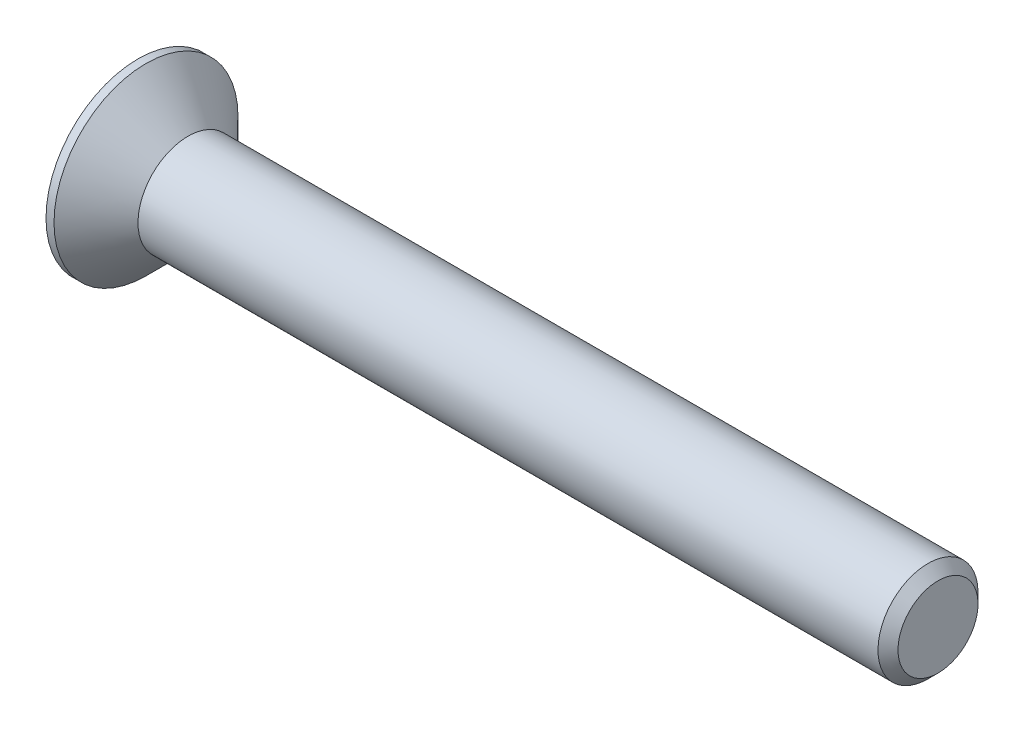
ISO-10303-21;
HEADER;
FILE_DESCRIPTION(('STEP AP214'),'2;1');
FILE_NAME('part.step','',(''),(''),'','','');
FILE_SCHEMA(('AUTOMOTIVE_DESIGN { 1 0 10303 214 1 1 1 1 }'));
ENDSEC;
DATA;
#1=APPLICATION_CONTEXT('core data for automotive mechanical design processes');
#2=APPLICATION_PROTOCOL_DEFINITION('international standard','automotive_design',2000,#1);
#3=PRODUCT_CONTEXT('',#1,'mechanical');
#4=PRODUCT('Part','Part','',(#3));
#5=PRODUCT_RELATED_PRODUCT_CATEGORY('part','',(#4));
#6=PRODUCT_DEFINITION_FORMATION('','',#4);
#7=PRODUCT_DEFINITION_CONTEXT('part definition',#1,'design');
#8=PRODUCT_DEFINITION('design','',#6,#7);
#9=PRODUCT_DEFINITION_SHAPE('','',#8);
#10=(LENGTH_UNIT() NAMED_UNIT(*) SI_UNIT(.MILLI.,.METRE.));
#11=(NAMED_UNIT(*) PLANE_ANGLE_UNIT() SI_UNIT($,.RADIAN.));
#12=(NAMED_UNIT(*) SI_UNIT($,.STERADIAN.) SOLID_ANGLE_UNIT());
#13=UNCERTAINTY_MEASURE_WITH_UNIT(LENGTH_MEASURE(1.E-05),#10,'distance_accuracy_value','');
#14=(GEOMETRIC_REPRESENTATION_CONTEXT(3) GLOBAL_UNCERTAINTY_ASSIGNED_CONTEXT((#13)) GLOBAL_UNIT_ASSIGNED_CONTEXT((#10,
#11,#12)) REPRESENTATION_CONTEXT('',''));
#15=CARTESIAN_POINT('',(0.,0.,0.));
#16=DIRECTION('',(0.,0.,1.));
#17=DIRECTION('',(1.,0.,0.));
#18=AXIS2_PLACEMENT_3D('',#15,#16,#17);
#19=CARTESIAN_POINT('',(0.,0.,0.));
#20=DIRECTION('',(-1.,0.,0.));
#21=DIRECTION('',(0.,-1.,0.));
#22=AXIS2_PLACEMENT_3D('',#19,#20,#21);
#23=CONICAL_SURFACE('',#22,2.5,0.78539816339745);
#24=CARTESIAN_POINT('',(-2.09999999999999,0.,0.));
#25=DIRECTION('',(-1.,0.,0.));
#26=DIRECTION('',(0.,-1.,0.));
#27=AXIS2_PLACEMENT_3D('',#24,#25,#26);
#28=CIRCLE('',#27,4.6);
#29=CARTESIAN_POINT('',(-2.09999999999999,-4.6,0.));
#30=VERTEX_POINT('',#29);
#31=EDGE_CURVE('E189',#30,#30,#28,.T.);
#32=ORIENTED_EDGE('',*,*,#31,.F.);
#33=EDGE_LOOP('',(#32));
#34=FACE_BOUND('',#33,.T.);
#35=CARTESIAN_POINT('',(0.,0.,0.));
#36=DIRECTION('',(-1.,0.,0.));
#37=DIRECTION('',(0.,-1.,0.));
#38=AXIS2_PLACEMENT_3D('',#35,#36,#37);
#39=CIRCLE('',#38,2.5);
#40=CARTESIAN_POINT('',(0.,-2.5,0.));
#41=VERTEX_POINT('',#40);
#42=EDGE_CURVE('E212',#41,#41,#39,.T.);
#43=ORIENTED_EDGE('',*,*,#42,.T.);
#44=EDGE_LOOP('',(#43));
#45=FACE_BOUND('',#44,.T.);
#46=ADVANCED_FACE('F33',(#34,#45),#23,.T.);
#47=CARTESIAN_POINT('',(-2.5,0.,0.));
#48=DIRECTION('',(-1.,0.,0.));
#49=DIRECTION('',(0.,-1.,0.));
#50=AXIS2_PLACEMENT_3D('',#47,#48,#49);
#51=CYLINDRICAL_SURFACE('',#50,2.5);
#52=CARTESIAN_POINT('',(37.,0.,0.));
#53=DIRECTION('',(-1.,0.,0.));
#54=DIRECTION('',(0.,-1.,0.));
#55=AXIS2_PLACEMENT_3D('',#52,#53,#54);
#56=CIRCLE('',#55,2.5);
#57=CARTESIAN_POINT('',(37.,-2.5,0.));
#58=VERTEX_POINT('',#57);
#59=EDGE_CURVE('E41',#58,#58,#56,.T.);
#60=ORIENTED_EDGE('',*,*,#59,.T.);
#61=EDGE_LOOP('',(#60));
#62=FACE_BOUND('',#61,.T.);
#63=ORIENTED_EDGE('',*,*,#42,.F.);
#64=EDGE_LOOP('',(#63));
#65=FACE_BOUND('',#64,.T.);
#66=ADVANCED_FACE('F217',(#62,#65),#51,.T.);
#67=CARTESIAN_POINT('',(37.5,0.,0.));
#68=DIRECTION('',(-1.,0.,0.));
#69=DIRECTION('',(0.,-1.,0.));
#70=AXIS2_PLACEMENT_3D('',#67,#68,#69);
#71=PLANE('',#70);
#72=CARTESIAN_POINT('',(37.5,0.,0.));
#73=DIRECTION('',(-1.,0.,0.));
#74=DIRECTION('',(0.,-1.,0.));
#75=AXIS2_PLACEMENT_3D('',#72,#73,#74);
#76=CIRCLE('',#75,2.00000000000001);
#77=CARTESIAN_POINT('',(37.5,-2.00000000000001,0.));
#78=VERTEX_POINT('',#77);
#79=EDGE_CURVE('E11',#78,#78,#76,.F.);
#80=ORIENTED_EDGE('',*,*,#79,.T.);
#81=EDGE_LOOP('',(#80));
#82=FACE_BOUND('',#81,.T.);
#83=ADVANCED_FACE('F239',(#82),#71,.F.);
#84=CARTESIAN_POINT('',(-2.5,4.6,0.));
#85=DIRECTION('',(1.,0.,0.));
#86=DIRECTION('',(0.,1.,0.));
#87=AXIS2_PLACEMENT_3D('',#84,#85,#86);
#88=PLANE('',#87);
#89=DIRECTION('',(0.,0.,-1.));
#90=VECTOR('',#89,1.);
#91=CARTESIAN_POINT('',(-2.5,0.575,-2.3));
#92=LINE('',#91,#90);
#93=CARTESIAN_POINT('',(-2.5,0.575,-0.575));
#94=VERTEX_POINT('',#93);
#95=CARTESIAN_POINT('',(-2.5,0.575,-2.3));
#96=VERTEX_POINT('',#95);
#97=EDGE_CURVE('E158',#94,#96,#92,.T.);
#98=ORIENTED_EDGE('',*,*,#97,.F.);
#99=DIRECTION('',(0.,-1.,0.));
#100=VECTOR('',#99,1.);
#101=CARTESIAN_POINT('',(-2.5,0.575,-0.575));
#102=LINE('',#101,#100);
#103=CARTESIAN_POINT('',(-2.5,2.3,-0.575));
#104=VERTEX_POINT('',#103);
#105=EDGE_CURVE('E48',#104,#94,#102,.T.);
#106=ORIENTED_EDGE('',*,*,#105,.F.);
#107=DIRECTION('',(0.,0.,-1.));
#108=VECTOR('',#107,1.);
#109=CARTESIAN_POINT('',(-2.5,2.3,-0.575));
#110=LINE('',#109,#108);
#111=CARTESIAN_POINT('',(-2.5,2.3,0.575));
#112=VERTEX_POINT('',#111);
#113=EDGE_CURVE('E185',#112,#104,#110,.T.);
#114=ORIENTED_EDGE('',*,*,#113,.F.);
#115=DIRECTION('',(0.,1.,0.));
#116=VECTOR('',#115,1.);
#117=CARTESIAN_POINT('',(-2.5,2.3,0.575));
#118=LINE('',#117,#116);
#119=CARTESIAN_POINT('',(-2.5,0.575,0.575));
#120=VERTEX_POINT('',#119);
#121=EDGE_CURVE('E183',#120,#112,#118,.T.);
#122=ORIENTED_EDGE('',*,*,#121,.F.);
#123=DIRECTION('',(0.,0.,-1.));
#124=VECTOR('',#123,1.);
#125=CARTESIAN_POINT('',(-2.5,0.575,0.575));
#126=LINE('',#125,#124);
#127=CARTESIAN_POINT('',(-2.5,0.575,2.3));
#128=VERTEX_POINT('',#127);
#129=EDGE_CURVE('E132',#128,#120,#126,.T.);
#130=ORIENTED_EDGE('',*,*,#129,.F.);
#131=DIRECTION('',(0.,1.,0.));
#132=VECTOR('',#131,1.);
#133=CARTESIAN_POINT('',(-2.5,0.575,2.3));
#134=LINE('',#133,#132);
#135=CARTESIAN_POINT('',(-2.5,-0.575,2.3));
#136=VERTEX_POINT('',#135);
#137=EDGE_CURVE('E179',#136,#128,#134,.T.);
#138=ORIENTED_EDGE('',*,*,#137,.F.);
#139=DIRECTION('',(0.,0.,1.));
#140=VECTOR('',#139,1.);
#141=CARTESIAN_POINT('',(-2.5,-0.575,2.3));
#142=LINE('',#141,#140);
#143=CARTESIAN_POINT('',(-2.5,-0.575,0.575));
#144=VERTEX_POINT('',#143);
#145=EDGE_CURVE('E176',#144,#136,#142,.T.);
#146=ORIENTED_EDGE('',*,*,#145,.F.);
#147=DIRECTION('',(0.,1.,0.));
#148=VECTOR('',#147,1.);
#149=CARTESIAN_POINT('',(-2.5,-0.575,0.575));
#150=LINE('',#149,#148);
#151=CARTESIAN_POINT('',(-2.5,-2.3,0.575));
#152=VERTEX_POINT('',#151);
#153=EDGE_CURVE('E173',#152,#144,#150,.T.);
#154=ORIENTED_EDGE('',*,*,#153,.F.);
#155=DIRECTION('',(0.,0.,1.));
#156=VECTOR('',#155,1.);
#157=CARTESIAN_POINT('',(-2.5,-2.3,0.575));
#158=LINE('',#157,#156);
#159=CARTESIAN_POINT('',(-2.5,-2.3,-0.575));
#160=VERTEX_POINT('',#159);
#161=EDGE_CURVE('E170',#160,#152,#158,.T.);
#162=ORIENTED_EDGE('',*,*,#161,.F.);
#163=DIRECTION('',(0.,-1.,0.));
#164=VECTOR('',#163,1.);
#165=CARTESIAN_POINT('',(-2.5,-2.3,-0.575));
#166=LINE('',#165,#164);
#167=CARTESIAN_POINT('',(-2.5,-0.575,-0.575));
#168=VERTEX_POINT('',#167);
#169=EDGE_CURVE('E167',#168,#160,#166,.T.);
#170=ORIENTED_EDGE('',*,*,#169,.F.);
#171=DIRECTION('',(0.,0.,1.));
#172=VECTOR('',#171,1.);
#173=CARTESIAN_POINT('',(-2.5,-0.575,-0.575));
#174=LINE('',#173,#172);
#175=CARTESIAN_POINT('',(-2.5,-0.575,-2.3));
#176=VERTEX_POINT('',#175);
#177=EDGE_CURVE('E164',#176,#168,#174,.T.);
#178=ORIENTED_EDGE('',*,*,#177,.F.);
#179=DIRECTION('',(0.,-1.,0.));
#180=VECTOR('',#179,1.);
#181=CARTESIAN_POINT('',(-2.5,-0.575,-2.3));
#182=LINE('',#181,#180);
#183=EDGE_CURVE('E161',#96,#176,#182,.T.);
#184=ORIENTED_EDGE('',*,*,#183,.F.);
#185=EDGE_LOOP('',(#98,#106,#114,#122,#130,#138,#146,#154,#162,#170,#178,#184));
#186=FACE_BOUND('',#185,.T.);
#187=CARTESIAN_POINT('',(-2.5,0.,0.));
#188=DIRECTION('',(-1.,0.,0.));
#189=DIRECTION('',(0.,-1.,0.));
#190=AXIS2_PLACEMENT_3D('',#187,#188,#189);
#191=CIRCLE('',#190,4.6);
#192=CARTESIAN_POINT('',(-2.5,-4.6,0.));
#193=VERTEX_POINT('',#192);
#194=EDGE_CURVE('E209',#193,#193,#191,.T.);
#195=ORIENTED_EDGE('',*,*,#194,.T.);
#196=EDGE_LOOP('',(#195));
#197=FACE_BOUND('',#196,.T.);
#198=ADVANCED_FACE('F230',(#186,#197),#88,.F.);
#199=CARTESIAN_POINT('',(-2.5,0.,0.));
#200=DIRECTION('',(-1.,0.,0.));
#201=DIRECTION('',(0.,-1.,0.));
#202=AXIS2_PLACEMENT_3D('',#199,#200,#201);
#203=CYLINDRICAL_SURFACE('',#202,4.6);
#204=ORIENTED_EDGE('',*,*,#194,.F.);
#205=EDGE_LOOP('',(#204));
#206=FACE_BOUND('',#205,.T.);
#207=ORIENTED_EDGE('',*,*,#31,.T.);
#208=EDGE_LOOP('',(#207));
#209=FACE_BOUND('',#208,.T.);
#210=ADVANCED_FACE('F222',(#206,#209),#203,.T.);
#211=CARTESIAN_POINT('',(37.,0.,0.));
#212=DIRECTION('',(-1.,0.,0.));
#213=DIRECTION('',(0.,-1.,0.));
#214=AXIS2_PLACEMENT_3D('',#211,#212,#213);
#215=CONICAL_SURFACE('',#214,2.5,0.785398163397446);
#216=ORIENTED_EDGE('',*,*,#79,.F.);
#217=EDGE_LOOP('',(#216));
#218=FACE_BOUND('',#217,.T.);
#219=ORIENTED_EDGE('',*,*,#59,.F.);
#220=EDGE_LOOP('',(#219));
#221=FACE_BOUND('',#220,.T.);
#222=ADVANCED_FACE('F35',(#218,#221),#215,.T.);
#223=CARTESIAN_POINT('',(-0.4,0.575,-0.575));
#224=DIRECTION('',(0.,0.,-1.));
#225=DIRECTION('',(-1.,0.,0.));
#226=AXIS2_PLACEMENT_3D('',#223,#224,#225);
#227=PLANE('',#226);
#228=ORIENTED_EDGE('',*,*,#105,.T.);
#229=DIRECTION('',(-1.,0.,0.));
#230=VECTOR('',#229,1.);
#231=CARTESIAN_POINT('',(-0.4,0.575,-0.575));
#232=LINE('',#231,#230);
#233=CARTESIAN_POINT('',(-0.4,0.575,-0.575));
#234=VERTEX_POINT('',#233);
#235=EDGE_CURVE('E96',#234,#94,#232,.T.);
#236=ORIENTED_EDGE('',*,*,#235,.F.);
#237=DIRECTION('',(0.,-1.,0.));
#238=VECTOR('',#237,1.);
#239=CARTESIAN_POINT('',(-0.4,0.575,-0.575));
#240=LINE('',#239,#238);
#241=CARTESIAN_POINT('',(-0.4,2.3,-0.575));
#242=VERTEX_POINT('',#241);
#243=EDGE_CURVE('E187',#242,#234,#240,.T.);
#244=ORIENTED_EDGE('',*,*,#243,.F.);
#245=DIRECTION('',(-1.,0.,0.));
#246=VECTOR('',#245,1.);
#247=CARTESIAN_POINT('',(-0.4,2.3,-0.575));
#248=LINE('',#247,#246);
#249=EDGE_CURVE('E56',#242,#104,#248,.T.);
#250=ORIENTED_EDGE('',*,*,#249,.T.);
#251=EDGE_LOOP('',(#228,#236,#244,#250));
#252=FACE_BOUND('',#251,.T.);
#253=ADVANCED_FACE('F221',(#252),#227,.F.);
#254=CARTESIAN_POINT('',(-0.4,2.3,-0.575));
#255=DIRECTION('',(0.,1.,0.));
#256=DIRECTION('',(-1.,0.,0.));
#257=AXIS2_PLACEMENT_3D('',#254,#255,#256);
#258=PLANE('',#257);
#259=ORIENTED_EDGE('',*,*,#113,.T.);
#260=ORIENTED_EDGE('',*,*,#249,.F.);
#261=DIRECTION('',(0.,0.,-1.));
#262=VECTOR('',#261,1.);
#263=CARTESIAN_POINT('',(-0.4,2.3,-0.575));
#264=LINE('',#263,#262);
#265=CARTESIAN_POINT('',(-0.4,2.3,0.575));
#266=VERTEX_POINT('',#265);
#267=EDGE_CURVE('E144',#266,#242,#264,.T.);
#268=ORIENTED_EDGE('',*,*,#267,.F.);
#269=DIRECTION('',(-1.,0.,0.));
#270=VECTOR('',#269,1.);
#271=CARTESIAN_POINT('',(-0.4,2.3,0.575));
#272=LINE('',#271,#270);
#273=EDGE_CURVE('E136',#266,#112,#272,.T.);
#274=ORIENTED_EDGE('',*,*,#273,.T.);
#275=EDGE_LOOP('',(#259,#260,#268,#274));
#276=FACE_BOUND('',#275,.T.);
#277=ADVANCED_FACE('F228',(#276),#258,.F.);
#278=CARTESIAN_POINT('',(-0.4,2.3,0.575));
#279=DIRECTION('',(0.,0.,1.));
#280=DIRECTION('',(1.,0.,0.));
#281=AXIS2_PLACEMENT_3D('',#278,#279,#280);
#282=PLANE('',#281);
#283=ORIENTED_EDGE('',*,*,#121,.T.);
#284=ORIENTED_EDGE('',*,*,#273,.F.);
#285=DIRECTION('',(0.,1.,0.));
#286=VECTOR('',#285,1.);
#287=CARTESIAN_POINT('',(-0.4,2.3,0.575));
#288=LINE('',#287,#286);
#289=CARTESIAN_POINT('',(-0.4,0.575,0.575));
#290=VERTEX_POINT('',#289);
#291=EDGE_CURVE('E140',#290,#266,#288,.T.);
#292=ORIENTED_EDGE('',*,*,#291,.F.);
#293=DIRECTION('',(-1.,0.,0.));
#294=VECTOR('',#293,1.);
#295=CARTESIAN_POINT('',(-0.4,0.575,0.575));
#296=LINE('',#295,#294);
#297=EDGE_CURVE('E125',#290,#120,#296,.T.);
#298=ORIENTED_EDGE('',*,*,#297,.T.);
#299=EDGE_LOOP('',(#283,#284,#292,#298));
#300=FACE_BOUND('',#299,.T.);
#301=ADVANCED_FACE('F141',(#300),#282,.F.);
#302=CARTESIAN_POINT('',(-0.4,0.575,0.575));
#303=DIRECTION('',(0.,1.,0.));
#304=DIRECTION('',(-1.,0.,0.));
#305=AXIS2_PLACEMENT_3D('',#302,#303,#304);
#306=PLANE('',#305);
#307=ORIENTED_EDGE('',*,*,#129,.T.);
#308=ORIENTED_EDGE('',*,*,#297,.F.);
#309=DIRECTION('',(0.,0.,-1.));
#310=VECTOR('',#309,1.);
#311=CARTESIAN_POINT('',(-0.4,0.575,0.575));
#312=LINE('',#311,#310);
#313=CARTESIAN_POINT('',(-0.4,0.575,2.3));
#314=VERTEX_POINT('',#313);
#315=EDGE_CURVE('E129',#314,#290,#312,.T.);
#316=ORIENTED_EDGE('',*,*,#315,.F.);
#317=DIRECTION('',(-1.,0.,0.));
#318=VECTOR('',#317,1.);
#319=CARTESIAN_POINT('',(-0.4,0.575,2.3));
#320=LINE('',#319,#318);
#321=EDGE_CURVE('E137',#314,#128,#320,.T.);
#322=ORIENTED_EDGE('',*,*,#321,.T.);
#323=EDGE_LOOP('',(#307,#308,#316,#322));
#324=FACE_BOUND('',#323,.T.);
#325=ADVANCED_FACE('F127',(#324),#306,.F.);
#326=CARTESIAN_POINT('',(-0.4,0.575,2.3));
#327=DIRECTION('',(0.,0.,1.));
#328=DIRECTION('',(1.,0.,0.));
#329=AXIS2_PLACEMENT_3D('',#326,#327,#328);
#330=PLANE('',#329);
#331=ORIENTED_EDGE('',*,*,#137,.T.);
#332=ORIENTED_EDGE('',*,*,#321,.F.);
#333=DIRECTION('',(0.,1.,0.));
#334=VECTOR('',#333,1.);
#335=CARTESIAN_POINT('',(-0.4,0.575,2.3));
#336=LINE('',#335,#334);
#337=CARTESIAN_POINT('',(-0.4,-0.575,2.3));
#338=VERTEX_POINT('',#337);
#339=EDGE_CURVE('E150',#338,#314,#336,.T.);
#340=ORIENTED_EDGE('',*,*,#339,.F.);
#341=DIRECTION('',(-1.,0.,0.));
#342=VECTOR('',#341,1.);
#343=CARTESIAN_POINT('',(-0.4,-0.575,2.3));
#344=LINE('',#343,#342);
#345=EDGE_CURVE('E192',#338,#136,#344,.T.);
#346=ORIENTED_EDGE('',*,*,#345,.T.);
#347=EDGE_LOOP('',(#331,#332,#340,#346));
#348=FACE_BOUND('',#347,.T.);
#349=ADVANCED_FACE('F277',(#348),#330,.F.);
#350=CARTESIAN_POINT('',(-0.4,-0.575,2.3));
#351=DIRECTION('',(0.,-1.,0.));
#352=DIRECTION('',(1.,0.,0.));
#353=AXIS2_PLACEMENT_3D('',#350,#351,#352);
#354=PLANE('',#353);
#355=ORIENTED_EDGE('',*,*,#145,.T.);
#356=ORIENTED_EDGE('',*,*,#345,.F.);
#357=DIRECTION('',(0.,0.,1.));
#358=VECTOR('',#357,1.);
#359=CARTESIAN_POINT('',(-0.4,-0.575,2.3));
#360=LINE('',#359,#358);
#361=CARTESIAN_POINT('',(-0.4,-0.575,0.575));
#362=VERTEX_POINT('',#361);
#363=EDGE_CURVE('E152',#362,#338,#360,.T.);
#364=ORIENTED_EDGE('',*,*,#363,.F.);
#365=DIRECTION('',(-1.,0.,0.));
#366=VECTOR('',#365,1.);
#367=CARTESIAN_POINT('',(-0.4,-0.575,0.575));
#368=LINE('',#367,#366);
#369=EDGE_CURVE('E194',#362,#144,#368,.T.);
#370=ORIENTED_EDGE('',*,*,#369,.T.);
#371=EDGE_LOOP('',(#355,#356,#364,#370));
#372=FACE_BOUND('',#371,.T.);
#373=ADVANCED_FACE('F273',(#372),#354,.F.);
#374=CARTESIAN_POINT('',(-0.4,-0.575,0.575));
#375=DIRECTION('',(0.,0.,1.));
#376=DIRECTION('',(1.,0.,0.));
#377=AXIS2_PLACEMENT_3D('',#374,#375,#376);
#378=PLANE('',#377);
#379=ORIENTED_EDGE('',*,*,#153,.T.);
#380=ORIENTED_EDGE('',*,*,#369,.F.);
#381=DIRECTION('',(0.,1.,0.));
#382=VECTOR('',#381,1.);
#383=CARTESIAN_POINT('',(-0.4,-0.575,0.575));
#384=LINE('',#383,#382);
#385=CARTESIAN_POINT('',(-0.4,-2.3,0.575));
#386=VERTEX_POINT('',#385);
#387=EDGE_CURVE('E422',#386,#362,#384,.T.);
#388=ORIENTED_EDGE('',*,*,#387,.F.);
#389=DIRECTION('',(-1.,0.,0.));
#390=VECTOR('',#389,1.);
#391=CARTESIAN_POINT('',(-0.4,-2.3,0.575));
#392=LINE('',#391,#390);
#393=EDGE_CURVE('E196',#386,#152,#392,.T.);
#394=ORIENTED_EDGE('',*,*,#393,.T.);
#395=EDGE_LOOP('',(#379,#380,#388,#394));
#396=FACE_BOUND('',#395,.T.);
#397=ADVANCED_FACE('F269',(#396),#378,.F.);
#398=CARTESIAN_POINT('',(-0.4,-2.3,0.575));
#399=DIRECTION('',(0.,-1.,0.));
#400=DIRECTION('',(1.,0.,0.));
#401=AXIS2_PLACEMENT_3D('',#398,#399,#400);
#402=PLANE('',#401);
#403=ORIENTED_EDGE('',*,*,#161,.T.);
#404=ORIENTED_EDGE('',*,*,#393,.F.);
#405=DIRECTION('',(0.,0.,1.));
#406=VECTOR('',#405,1.);
#407=CARTESIAN_POINT('',(-0.4,-2.3,0.575));
#408=LINE('',#407,#406);
#409=CARTESIAN_POINT('',(-0.4,-2.3,-0.575));
#410=VERTEX_POINT('',#409);
#411=EDGE_CURVE('E419',#410,#386,#408,.T.);
#412=ORIENTED_EDGE('',*,*,#411,.F.);
#413=DIRECTION('',(-1.,0.,0.));
#414=VECTOR('',#413,1.);
#415=CARTESIAN_POINT('',(-0.4,-2.3,-0.575));
#416=LINE('',#415,#414);
#417=EDGE_CURVE('E198',#410,#160,#416,.T.);
#418=ORIENTED_EDGE('',*,*,#417,.T.);
#419=EDGE_LOOP('',(#403,#404,#412,#418));
#420=FACE_BOUND('',#419,.T.);
#421=ADVANCED_FACE('F265',(#420),#402,.F.);
#422=CARTESIAN_POINT('',(-0.4,-2.3,-0.575));
#423=DIRECTION('',(0.,0.,-1.));
#424=DIRECTION('',(-1.,0.,0.));
#425=AXIS2_PLACEMENT_3D('',#422,#423,#424);
#426=PLANE('',#425);
#427=ORIENTED_EDGE('',*,*,#169,.T.);
#428=ORIENTED_EDGE('',*,*,#417,.F.);
#429=DIRECTION('',(0.,-1.,0.));
#430=VECTOR('',#429,1.);
#431=CARTESIAN_POINT('',(-0.4,-2.3,-0.575));
#432=LINE('',#431,#430);
#433=CARTESIAN_POINT('',(-0.4,-0.575,-0.575));
#434=VERTEX_POINT('',#433);
#435=EDGE_CURVE('E416',#434,#410,#432,.T.);
#436=ORIENTED_EDGE('',*,*,#435,.F.);
#437=DIRECTION('',(-1.,0.,0.));
#438=VECTOR('',#437,1.);
#439=CARTESIAN_POINT('',(-0.4,-0.575,-0.575));
#440=LINE('',#439,#438);
#441=EDGE_CURVE('E200',#434,#168,#440,.T.);
#442=ORIENTED_EDGE('',*,*,#441,.T.);
#443=EDGE_LOOP('',(#427,#428,#436,#442));
#444=FACE_BOUND('',#443,.T.);
#445=ADVANCED_FACE('F261',(#444),#426,.F.);
#446=CARTESIAN_POINT('',(-0.4,-0.575,-0.575));
#447=DIRECTION('',(0.,-1.,0.));
#448=DIRECTION('',(1.,0.,0.));
#449=AXIS2_PLACEMENT_3D('',#446,#447,#448);
#450=PLANE('',#449);
#451=ORIENTED_EDGE('',*,*,#177,.T.);
#452=ORIENTED_EDGE('',*,*,#441,.F.);
#453=DIRECTION('',(0.,0.,1.));
#454=VECTOR('',#453,1.);
#455=CARTESIAN_POINT('',(-0.4,-0.575,-0.575));
#456=LINE('',#455,#454);
#457=CARTESIAN_POINT('',(-0.4,-0.575,-2.3));
#458=VERTEX_POINT('',#457);
#459=EDGE_CURVE('E413',#458,#434,#456,.T.);
#460=ORIENTED_EDGE('',*,*,#459,.F.);
#461=DIRECTION('',(-1.,0.,0.));
#462=VECTOR('',#461,1.);
#463=CARTESIAN_POINT('',(-0.4,-0.575,-2.3));
#464=LINE('',#463,#462);
#465=EDGE_CURVE('E202',#458,#176,#464,.T.);
#466=ORIENTED_EDGE('',*,*,#465,.T.);
#467=EDGE_LOOP('',(#451,#452,#460,#466));
#468=FACE_BOUND('',#467,.T.);
#469=ADVANCED_FACE('F257',(#468),#450,.F.);
#470=CARTESIAN_POINT('',(-0.4,-0.575,-2.3));
#471=DIRECTION('',(0.,0.,-1.));
#472=DIRECTION('',(-1.,0.,0.));
#473=AXIS2_PLACEMENT_3D('',#470,#471,#472);
#474=PLANE('',#473);
#475=ORIENTED_EDGE('',*,*,#183,.T.);
#476=ORIENTED_EDGE('',*,*,#465,.F.);
#477=DIRECTION('',(0.,-1.,0.));
#478=VECTOR('',#477,1.);
#479=CARTESIAN_POINT('',(-0.4,-0.575,-2.3));
#480=LINE('',#479,#478);
#481=CARTESIAN_POINT('',(-0.4,0.575,-2.3));
#482=VERTEX_POINT('',#481);
#483=EDGE_CURVE('E408',#482,#458,#480,.T.);
#484=ORIENTED_EDGE('',*,*,#483,.F.);
#485=DIRECTION('',(-1.,0.,0.));
#486=VECTOR('',#485,1.);
#487=CARTESIAN_POINT('',(-0.4,0.575,-2.3));
#488=LINE('',#487,#486);
#489=EDGE_CURVE('E204',#482,#96,#488,.T.);
#490=ORIENTED_EDGE('',*,*,#489,.T.);
#491=EDGE_LOOP('',(#475,#476,#484,#490));
#492=FACE_BOUND('',#491,.T.);
#493=ADVANCED_FACE('F253',(#492),#474,.F.);
#494=CARTESIAN_POINT('',(-0.4,0.575,-2.3));
#495=DIRECTION('',(0.,1.,0.));
#496=DIRECTION('',(-1.,0.,0.));
#497=AXIS2_PLACEMENT_3D('',#494,#495,#496);
#498=PLANE('',#497);
#499=ORIENTED_EDGE('',*,*,#97,.T.);
#500=ORIENTED_EDGE('',*,*,#489,.F.);
#501=DIRECTION('',(0.,0.,-1.));
#502=VECTOR('',#501,1.);
#503=CARTESIAN_POINT('',(-0.4,0.575,-2.3));
#504=LINE('',#503,#502);
#505=EDGE_CURVE('E406',#234,#482,#504,.T.);
#506=ORIENTED_EDGE('',*,*,#505,.F.);
#507=ORIENTED_EDGE('',*,*,#235,.T.);
#508=EDGE_LOOP('',(#499,#500,#506,#507));
#509=FACE_BOUND('',#508,.T.);
#510=ADVANCED_FACE('F250',(#509),#498,.F.);
#511=CARTESIAN_POINT('',(-0.4,0.,0.));
#512=DIRECTION('',(1.,0.,0.));
#513=DIRECTION('',(0.,0.,-1.));
#514=AXIS2_PLACEMENT_3D('',#511,#512,#513);
#515=PLANE('',#514);
#516=ORIENTED_EDGE('',*,*,#243,.T.);
#517=ORIENTED_EDGE('',*,*,#505,.T.);
#518=ORIENTED_EDGE('',*,*,#483,.T.);
#519=ORIENTED_EDGE('',*,*,#459,.T.);
#520=ORIENTED_EDGE('',*,*,#435,.T.);
#521=ORIENTED_EDGE('',*,*,#411,.T.);
#522=ORIENTED_EDGE('',*,*,#387,.T.);
#523=ORIENTED_EDGE('',*,*,#363,.T.);
#524=ORIENTED_EDGE('',*,*,#339,.T.);
#525=ORIENTED_EDGE('',*,*,#315,.T.);
#526=ORIENTED_EDGE('',*,*,#291,.T.);
#527=ORIENTED_EDGE('',*,*,#267,.T.);
#528=EDGE_LOOP('',(#516,#517,#518,#519,#520,#521,#522,#523,#524,#525,#526,#527));
#529=FACE_BOUND('',#528,.T.);
#530=ADVANCED_FACE('F147',(#529),#515,.F.);
#531=CLOSED_SHELL('',(#46,#66,#83,#198,#210,#222,#253,#277,#301,#325,#349,#373,#397,#421,#445,
#469,#493,#510,#530));
#532=MANIFOLD_SOLID_BREP('B2',#531);
#533=ADVANCED_BREP_SHAPE_REPRESENTATION('',(#18,#532),#14);
#534=SHAPE_DEFINITION_REPRESENTATION(#9,#533);
ENDSEC;
END-ISO-10303-21;
